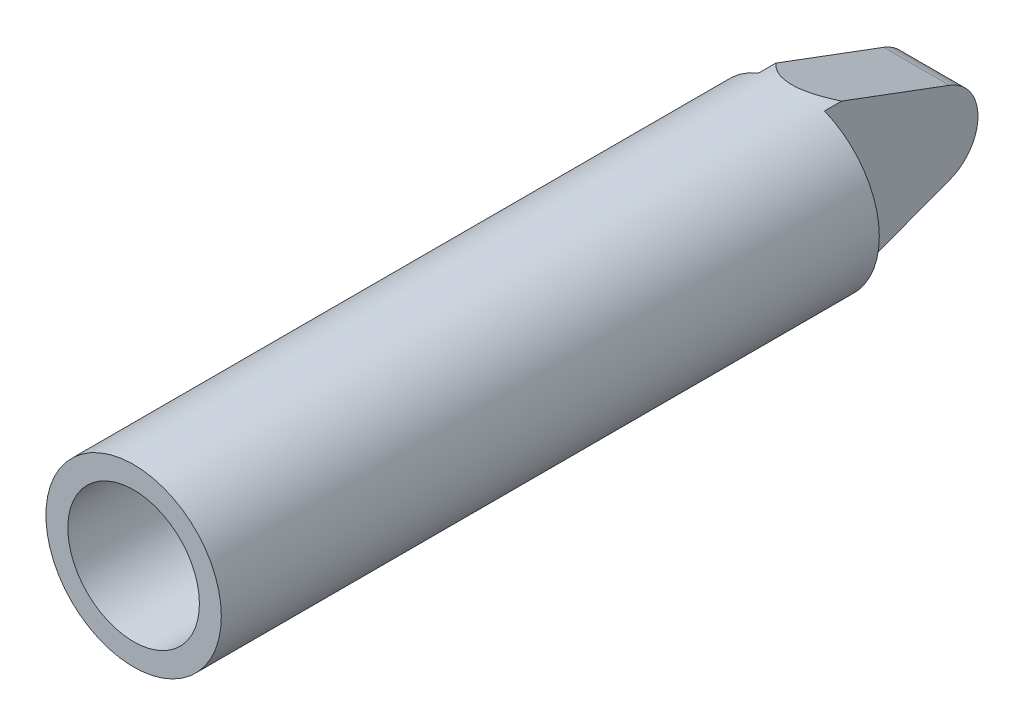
ISO-10303-21;
HEADER;
FILE_DESCRIPTION(('STEP AP214'),'2;1');
FILE_NAME('part.step','',(''),(''),'','','');
FILE_SCHEMA(('AUTOMOTIVE_DESIGN { 1 0 10303 214 1 1 1 1 }'));
ENDSEC;
DATA;
#1=APPLICATION_CONTEXT('core data for automotive mechanical design processes');
#2=APPLICATION_PROTOCOL_DEFINITION('international standard','automotive_design',2000,#1);
#3=PRODUCT_CONTEXT('',#1,'mechanical');
#4=PRODUCT('Part','Part','',(#3));
#5=PRODUCT_RELATED_PRODUCT_CATEGORY('part','',(#4));
#6=PRODUCT_DEFINITION_FORMATION('','',#4);
#7=PRODUCT_DEFINITION_CONTEXT('part definition',#1,'design');
#8=PRODUCT_DEFINITION('design','',#6,#7);
#9=PRODUCT_DEFINITION_SHAPE('','',#8);
#10=(LENGTH_UNIT() NAMED_UNIT(*) SI_UNIT(.MILLI.,.METRE.));
#11=(NAMED_UNIT(*) PLANE_ANGLE_UNIT() SI_UNIT($,.RADIAN.));
#12=(NAMED_UNIT(*) SI_UNIT($,.STERADIAN.) SOLID_ANGLE_UNIT());
#13=UNCERTAINTY_MEASURE_WITH_UNIT(LENGTH_MEASURE(1.E-05),#10,'distance_accuracy_value','');
#14=(GEOMETRIC_REPRESENTATION_CONTEXT(3) GLOBAL_UNCERTAINTY_ASSIGNED_CONTEXT((#13)) GLOBAL_UNIT_ASSIGNED_CONTEXT((#10,
#11,#12)) REPRESENTATION_CONTEXT('',''));
#15=CARTESIAN_POINT('',(0.,0.,0.));
#16=DIRECTION('',(0.,0.,1.));
#17=DIRECTION('',(1.,0.,0.));
#18=AXIS2_PLACEMENT_3D('',#15,#16,#17);
#19=CARTESIAN_POINT('',(15.,-0.431086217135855,-106.062907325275));
#20=DIRECTION('',(0.,0.936922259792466,0.349537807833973));
#21=DIRECTION('',(0.,-0.349537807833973,0.936922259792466));
#22=AXIS2_PLACEMENT_3D('',#19,#20,#21);
#23=PLANE('',#22);
#24=DIRECTION('',(0.,0.349537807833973,-0.936922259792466));
#25=VECTOR('',#24,1.);
#26=CARTESIAN_POINT('',(15.,-0.431086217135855,-106.062907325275));
#27=LINE('',#26,#25);
#28=CARTESIAN_POINT('',(15.,-37.0809924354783,-7.82428424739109));
#29=VERTEX_POINT('',#28);
#30=CARTESIAN_POINT('',(15.,-18.7384451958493,-56.9907561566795));
#31=VERTEX_POINT('',#30);
#32=EDGE_CURVE('E129',#29,#31,#27,.T.);
#33=ORIENTED_EDGE('',*,*,#32,.F.);
#34=CARTESIAN_POINT('',(0.,0.,-107.218416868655));
#35=DIRECTION('',(0.,0.936922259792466,0.349537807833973));
#36=DIRECTION('',(0.,-0.349537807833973,0.936922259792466));
#37=AXIS2_PLACEMENT_3D('',#34,#35,#36);
#38=ELLIPSE('',#37,114.43683373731,40.);
#39=CARTESIAN_POINT('',(-15.,-37.0809924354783,-7.82428424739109));
#40=VERTEX_POINT('',#39);
#41=EDGE_CURVE('E119',#40,#29,#38,.T.);
#42=ORIENTED_EDGE('',*,*,#41,.F.);
#43=DIRECTION('',(0.,0.349537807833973,-0.936922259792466));
#44=VECTOR('',#43,1.);
#45=CARTESIAN_POINT('',(-15.,-0.431086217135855,-106.062907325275));
#46=LINE('',#45,#44);
#47=CARTESIAN_POINT('',(-15.,-18.7384451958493,-56.9907561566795));
#48=VERTEX_POINT('',#47);
#49=EDGE_CURVE('E127',#40,#48,#46,.T.);
#50=ORIENTED_EDGE('',*,*,#49,.T.);
#51=DIRECTION('',(-1.,0.,0.));
#52=VECTOR('',#51,1.);
#53=CARTESIAN_POINT('',(15.,-18.7384451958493,-56.9907561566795));
#54=LINE('',#53,#52);
#55=EDGE_CURVE('E152',#31,#48,#54,.T.);
#56=ORIENTED_EDGE('',*,*,#55,.F.);
#57=EDGE_LOOP('',(#33,#42,#50,#56));
#58=FACE_BOUND('',#57,.T.);
#59=ADVANCED_FACE('F31',(#58),#23,.F.);
#60=CARTESIAN_POINT('',(15.,0.431086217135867,-106.062907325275));
#61=DIRECTION('',(0.,0.936922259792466,-0.349537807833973));
#62=DIRECTION('',(0.,0.349537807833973,0.936922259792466));
#63=AXIS2_PLACEMENT_3D('',#60,#61,#62);
#64=PLANE('',#63);
#65=DIRECTION('',(0.,-0.349537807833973,-0.936922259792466));
#66=VECTOR('',#65,1.);
#67=CARTESIAN_POINT('',(-15.,0.431086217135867,-106.062907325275));
#68=LINE('',#67,#66);
#69=CARTESIAN_POINT('',(-15.,37.0809924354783,-7.82428424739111));
#70=VERTEX_POINT('',#69);
#71=CARTESIAN_POINT('',(-15.,18.7384451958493,-56.9907561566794));
#72=VERTEX_POINT('',#71);
#73=EDGE_CURVE('E138',#70,#72,#68,.T.);
#74=ORIENTED_EDGE('',*,*,#73,.F.);
#75=CARTESIAN_POINT('',(0.,0.,-107.218416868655));
#76=DIRECTION('',(0.,0.936922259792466,-0.349537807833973));
#77=DIRECTION('',(0.,0.349537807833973,0.936922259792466));
#78=AXIS2_PLACEMENT_3D('',#75,#76,#77);
#79=ELLIPSE('',#78,114.43683373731,40.);
#80=CARTESIAN_POINT('',(15.,37.0809924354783,-7.82428424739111));
#81=VERTEX_POINT('',#80);
#82=EDGE_CURVE('E45',#70,#81,#79,.T.);
#83=ORIENTED_EDGE('',*,*,#82,.T.);
#84=DIRECTION('',(0.,-0.349537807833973,-0.936922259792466));
#85=VECTOR('',#84,1.);
#86=CARTESIAN_POINT('',(15.,0.431086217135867,-106.062907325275));
#87=LINE('',#86,#85);
#88=CARTESIAN_POINT('',(15.,18.7384451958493,-56.9907561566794));
#89=VERTEX_POINT('',#88);
#90=EDGE_CURVE('E153',#81,#89,#87,.T.);
#91=ORIENTED_EDGE('',*,*,#90,.T.);
#92=DIRECTION('',(-1.,0.,0.));
#93=VECTOR('',#92,1.);
#94=CARTESIAN_POINT('',(15.,18.7384451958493,-56.9907561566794));
#95=LINE('',#94,#93);
#96=EDGE_CURVE('E149',#89,#72,#95,.T.);
#97=ORIENTED_EDGE('',*,*,#96,.T.);
#98=EDGE_LOOP('',(#74,#83,#91,#97));
#99=FACE_BOUND('',#98,.T.);
#100=ADVANCED_FACE('F228',(#99),#64,.T.);
#101=CARTESIAN_POINT('',(15.,0.,-105.902081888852));
#102=DIRECTION('',(1.,0.,0.));
#103=DIRECTION('',(0.,0.,-1.));
#104=AXIS2_PLACEMENT_3D('',#101,#102,#103);
#105=PLANE('',#104);
#106=ORIENTED_EDGE('',*,*,#90,.F.);
#107=DIRECTION('',(0.,0.,1.));
#108=VECTOR('',#107,1.);
#109=CARTESIAN_POINT('',(15.,37.0809924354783,-70.));
#110=LINE('',#109,#108);
#111=CARTESIAN_POINT('',(15.,37.0809924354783,0.));
#112=VERTEX_POINT('',#111);
#113=EDGE_CURVE('E160',#81,#112,#110,.T.);
#114=ORIENTED_EDGE('',*,*,#113,.T.);
#115=DIRECTION('',(0.,-1.,0.));
#116=VECTOR('',#115,1.);
#117=CARTESIAN_POINT('',(15.,0.,0.));
#118=LINE('',#117,#116);
#119=CARTESIAN_POINT('',(15.,-37.0809924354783,0.));
#120=VERTEX_POINT('',#119);
#121=EDGE_CURVE('E144',#112,#120,#118,.T.);
#122=ORIENTED_EDGE('',*,*,#121,.T.);
#123=DIRECTION('',(0.,0.,1.));
#124=VECTOR('',#123,1.);
#125=CARTESIAN_POINT('',(15.,-37.0809924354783,-70.));
#126=LINE('',#125,#124);
#127=EDGE_CURVE('E130',#120,#29,#126,.F.);
#128=ORIENTED_EDGE('',*,*,#127,.T.);
#129=ORIENTED_EDGE('',*,*,#32,.T.);
#130=CARTESIAN_POINT('',(15.,0.,-50.));
#131=DIRECTION('',(1.,0.,0.));
#132=DIRECTION('',(0.,0.,-1.));
#133=AXIS2_PLACEMENT_3D('',#130,#131,#132);
#134=CIRCLE('',#133,20.);
#135=EDGE_CURVE('E225',#31,#89,#134,.T.);
#136=ORIENTED_EDGE('',*,*,#135,.T.);
#137=EDGE_LOOP('',(#106,#114,#122,#128,#129,#136));
#138=FACE_BOUND('',#137,.T.);
#139=ADVANCED_FACE('F167',(#138),#105,.T.);
#140=CARTESIAN_POINT('',(-15.,0.,-105.902081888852));
#141=DIRECTION('',(1.,0.,0.));
#142=DIRECTION('',(0.,0.,-1.));
#143=AXIS2_PLACEMENT_3D('',#140,#141,#142);
#144=PLANE('',#143);
#145=DIRECTION('',(0.,0.,1.));
#146=VECTOR('',#145,1.);
#147=CARTESIAN_POINT('',(-15.,37.0809924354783,-70.));
#148=LINE('',#147,#146);
#149=CARTESIAN_POINT('',(-15.,37.0809924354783,0.));
#150=VERTEX_POINT('',#149);
#151=EDGE_CURVE('E12',#70,#150,#148,.T.);
#152=ORIENTED_EDGE('',*,*,#151,.F.);
#153=ORIENTED_EDGE('',*,*,#73,.T.);
#154=CARTESIAN_POINT('',(-15.,0.,-50.));
#155=DIRECTION('',(1.,0.,0.));
#156=DIRECTION('',(0.,0.,-1.));
#157=AXIS2_PLACEMENT_3D('',#154,#155,#156);
#158=CIRCLE('',#157,20.);
#159=EDGE_CURVE('E134',#48,#72,#158,.T.);
#160=ORIENTED_EDGE('',*,*,#159,.F.);
#161=ORIENTED_EDGE('',*,*,#49,.F.);
#162=DIRECTION('',(0.,0.,1.));
#163=VECTOR('',#162,1.);
#164=CARTESIAN_POINT('',(-15.,-37.0809924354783,-70.));
#165=LINE('',#164,#163);
#166=CARTESIAN_POINT('',(-15.,-37.0809924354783,0.));
#167=VERTEX_POINT('',#166);
#168=EDGE_CURVE('E39',#167,#40,#165,.F.);
#169=ORIENTED_EDGE('',*,*,#168,.F.);
#170=DIRECTION('',(0.,-1.,0.));
#171=VECTOR('',#170,1.);
#172=CARTESIAN_POINT('',(-15.,0.,0.));
#173=LINE('',#172,#171);
#174=EDGE_CURVE('E123',#150,#167,#173,.T.);
#175=ORIENTED_EDGE('',*,*,#174,.F.);
#176=EDGE_LOOP('',(#152,#153,#160,#161,#169,#175));
#177=FACE_BOUND('',#176,.T.);
#178=ADVANCED_FACE('F132',(#177),#144,.F.);
#179=CARTESIAN_POINT('',(0.,0.,0.));
#180=DIRECTION('',(0.,0.,1.));
#181=DIRECTION('',(1.,0.,0.));
#182=AXIS2_PLACEMENT_3D('',#179,#180,#181);
#183=PLANE('',#182);
#184=ORIENTED_EDGE('',*,*,#121,.F.);
#185=CARTESIAN_POINT('',(0.,0.,0.));
#186=DIRECTION('',(0.,0.,1.));
#187=DIRECTION('',(1.,0.,0.));
#188=AXIS2_PLACEMENT_3D('',#185,#186,#187);
#189=CIRCLE('',#188,40.);
#190=EDGE_CURVE('E155',#120,#112,#189,.T.);
#191=ORIENTED_EDGE('',*,*,#190,.F.);
#192=EDGE_LOOP('',(#184,#191));
#193=FACE_BOUND('',#192,.T.);
#194=ADVANCED_FACE('F164',(#193),#183,.F.);
#195=CARTESIAN_POINT('',(0.,0.,300.));
#196=DIRECTION('',(0.,0.,-1.));
#197=DIRECTION('',(-1.,0.,0.));
#198=AXIS2_PLACEMENT_3D('',#195,#196,#197);
#199=CYLINDRICAL_SURFACE('',#198,40.);
#200=CARTESIAN_POINT('',(0.,0.,300.));
#201=DIRECTION('',(0.,0.,1.));
#202=DIRECTION('',(1.,0.,0.));
#203=AXIS2_PLACEMENT_3D('',#200,#201,#202);
#204=CIRCLE('',#203,40.);
#205=CARTESIAN_POINT('',(40.,0.,300.));
#206=VERTEX_POINT('',#205);
#207=EDGE_CURVE('E156',#206,#206,#204,.T.);
#208=ORIENTED_EDGE('',*,*,#207,.F.);
#209=EDGE_LOOP('',(#208));
#210=FACE_BOUND('',#209,.T.);
#211=ORIENTED_EDGE('',*,*,#190,.T.);
#212=ORIENTED_EDGE('',*,*,#113,.F.);
#213=ORIENTED_EDGE('',*,*,#82,.F.);
#214=ORIENTED_EDGE('',*,*,#151,.T.);
#215=EDGE_CURVE('E122',#150,#167,#189,.T.);
#216=ORIENTED_EDGE('',*,*,#215,.T.);
#217=ORIENTED_EDGE('',*,*,#168,.T.);
#218=ORIENTED_EDGE('',*,*,#41,.T.);
#219=ORIENTED_EDGE('',*,*,#127,.F.);
#220=EDGE_LOOP('',(#211,#212,#213,#214,#216,#217,#218,#219));
#221=FACE_BOUND('',#220,.T.);
#222=ADVANCED_FACE('F33',(#210,#221),#199,.T.);
#223=CARTESIAN_POINT('',(0.,0.,300.));
#224=DIRECTION('',(0.,0.,1.));
#225=DIRECTION('',(1.,0.,0.));
#226=AXIS2_PLACEMENT_3D('',#223,#224,#225);
#227=PLANE('',#226);
#228=CARTESIAN_POINT('',(0.,0.,300.));
#229=DIRECTION('',(0.,0.,1.));
#230=DIRECTION('',(1.,0.,0.));
#231=AXIS2_PLACEMENT_3D('',#228,#229,#230);
#232=CIRCLE('',#231,30.);
#233=CARTESIAN_POINT('',(30.,0.,300.));
#234=VERTEX_POINT('',#233);
#235=EDGE_CURVE('E178',#234,#234,#232,.T.);
#236=ORIENTED_EDGE('',*,*,#235,.F.);
#237=EDGE_LOOP('',(#236));
#238=FACE_BOUND('',#237,.T.);
#239=ORIENTED_EDGE('',*,*,#207,.T.);
#240=EDGE_LOOP('',(#239));
#241=FACE_BOUND('',#240,.T.);
#242=ADVANCED_FACE('F245',(#238,#241),#227,.T.);
#243=ORIENTED_EDGE('',*,*,#215,.F.);
#244=ORIENTED_EDGE('',*,*,#174,.T.);
#245=EDGE_LOOP('',(#243,#244));
#246=FACE_BOUND('',#245,.T.);
#247=ADVANCED_FACE('F235',(#246),#183,.F.);
#248=CARTESIAN_POINT('',(15.,0.,-50.));
#249=DIRECTION('',(-1.,0.,0.));
#250=DIRECTION('',(0.,0.,1.));
#251=AXIS2_PLACEMENT_3D('',#248,#249,#250);
#252=CYLINDRICAL_SURFACE('',#251,20.);
#253=ORIENTED_EDGE('',*,*,#159,.T.);
#254=ORIENTED_EDGE('',*,*,#96,.F.);
#255=ORIENTED_EDGE('',*,*,#135,.F.);
#256=ORIENTED_EDGE('',*,*,#55,.T.);
#257=EDGE_LOOP('',(#253,#254,#255,#256));
#258=FACE_BOUND('',#257,.T.);
#259=ADVANCED_FACE('F232',(#258),#252,.T.);
#260=CARTESIAN_POINT('',(0.,0.,10.));
#261=DIRECTION('',(0.,0.,1.));
#262=DIRECTION('',(1.,0.,0.));
#263=AXIS2_PLACEMENT_3D('',#260,#261,#262);
#264=PLANE('',#263);
#265=DIRECTION('',(0.,-1.,0.));
#266=VECTOR('',#265,1.);
#267=CARTESIAN_POINT('',(5.,0.,9.99999999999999));
#268=LINE('',#267,#266);
#269=CARTESIAN_POINT('',(5.,29.5803989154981,10.));
#270=VERTEX_POINT('',#269);
#271=CARTESIAN_POINT('',(5.,-29.5803989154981,9.99999999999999));
#272=VERTEX_POINT('',#271);
#273=EDGE_CURVE('E174',#270,#272,#268,.T.);
#274=ORIENTED_EDGE('',*,*,#273,.T.);
#275=CARTESIAN_POINT('',(0.,0.,10.));
#276=DIRECTION('',(0.,0.,1.));
#277=DIRECTION('',(1.,0.,0.));
#278=AXIS2_PLACEMENT_3D('',#275,#276,#277);
#279=CIRCLE('',#278,30.);
#280=EDGE_CURVE('E179',#272,#270,#279,.T.);
#281=ORIENTED_EDGE('',*,*,#280,.T.);
#282=EDGE_LOOP('',(#274,#281));
#283=FACE_BOUND('',#282,.T.);
#284=ADVANCED_FACE('F234',(#283),#264,.T.);
#285=CARTESIAN_POINT('',(0.,0.,300.));
#286=DIRECTION('',(0.,0.,-1.));
#287=DIRECTION('',(-1.,0.,0.));
#288=AXIS2_PLACEMENT_3D('',#285,#286,#287);
#289=CYLINDRICAL_SURFACE('',#288,30.);
#290=ORIENTED_EDGE('',*,*,#235,.T.);
#291=EDGE_LOOP('',(#290));
#292=FACE_BOUND('',#291,.T.);
#293=DIRECTION('',(0.,0.,-1.));
#294=VECTOR('',#293,1.);
#295=CARTESIAN_POINT('',(5.,29.5803989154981,10.));
#296=LINE('',#295,#294);
#297=CARTESIAN_POINT('',(5.,29.5803989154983,0.679880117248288));
#298=VERTEX_POINT('',#297);
#299=EDGE_CURVE('E211',#270,#298,#296,.T.);
#300=ORIENTED_EDGE('',*,*,#299,.F.);
#301=ORIENTED_EDGE('',*,*,#280,.F.);
#302=DIRECTION('',(0.,0.,-1.));
#303=VECTOR('',#302,1.);
#304=CARTESIAN_POINT('',(5.,-29.5803989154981,9.99999999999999));
#305=LINE('',#304,#303);
#306=CARTESIAN_POINT('',(5.,-29.5803989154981,0.679880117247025));
#307=VERTEX_POINT('',#306);
#308=EDGE_CURVE('E141',#272,#307,#305,.T.);
#309=ORIENTED_EDGE('',*,*,#308,.T.);
#310=CARTESIAN_POINT('',(0.,0.,-78.6092084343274));
#311=DIRECTION('',(0.,0.936922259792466,0.349537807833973));
#312=DIRECTION('',(0.,0.349537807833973,-0.936922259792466));
#313=AXIS2_PLACEMENT_3D('',#310,#311,#312);
#314=ELLIPSE('',#313,85.8276253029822,30.);
#315=CARTESIAN_POINT('',(-5.,-29.5803989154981,0.679880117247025));
#316=VERTEX_POINT('',#315);
#317=EDGE_CURVE('E214',#316,#307,#314,.T.);
#318=ORIENTED_EDGE('',*,*,#317,.F.);
#319=DIRECTION('',(0.,0.,-1.));
#320=VECTOR('',#319,1.);
#321=CARTESIAN_POINT('',(-5.,-29.5803989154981,10.));
#322=LINE('',#321,#320);
#323=CARTESIAN_POINT('',(-5.,-29.5803989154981,10.));
#324=VERTEX_POINT('',#323);
#325=EDGE_CURVE('E217',#324,#316,#322,.T.);
#326=ORIENTED_EDGE('',*,*,#325,.F.);
#327=CARTESIAN_POINT('',(0.,0.,10.));
#328=DIRECTION('',(0.,0.,1.));
#329=DIRECTION('',(1.,0.,0.));
#330=AXIS2_PLACEMENT_3D('',#327,#328,#329);
#331=CIRCLE('',#330,30.);
#332=CARTESIAN_POINT('',(-5.,29.5803989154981,9.99999999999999));
#333=VERTEX_POINT('',#332);
#334=EDGE_CURVE('E182',#333,#324,#331,.T.);
#335=ORIENTED_EDGE('',*,*,#334,.F.);
#336=DIRECTION('',(0.,0.,-1.));
#337=VECTOR('',#336,1.);
#338=CARTESIAN_POINT('',(-5.,29.5803989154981,9.99999999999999));
#339=LINE('',#338,#337);
#340=CARTESIAN_POINT('',(-5.,29.580398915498,0.679880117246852));
#341=VERTEX_POINT('',#340);
#342=EDGE_CURVE('E188',#333,#341,#339,.T.);
#343=ORIENTED_EDGE('',*,*,#342,.T.);
#344=CARTESIAN_POINT('',(0.,0.,-78.6092084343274));
#345=DIRECTION('',(0.,0.936922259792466,-0.349537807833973));
#346=DIRECTION('',(0.,-0.349537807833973,-0.936922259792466));
#347=AXIS2_PLACEMENT_3D('',#344,#345,#346);
#348=ELLIPSE('',#347,85.8276253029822,30.);
#349=EDGE_CURVE('E136',#298,#341,#348,.F.);
#350=ORIENTED_EDGE('',*,*,#349,.F.);
#351=EDGE_LOOP('',(#300,#301,#309,#318,#326,#335,#343,#350));
#352=FACE_BOUND('',#351,.T.);
#353=ADVANCED_FACE('F241',(#292,#352),#289,.F.);
#354=ORIENTED_EDGE('',*,*,#334,.T.);
#355=DIRECTION('',(0.,-1.,0.));
#356=VECTOR('',#355,1.);
#357=CARTESIAN_POINT('',(-5.,0.,9.99999999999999));
#358=LINE('',#357,#356);
#359=EDGE_CURVE('E177',#333,#324,#358,.T.);
#360=ORIENTED_EDGE('',*,*,#359,.F.);
#361=EDGE_LOOP('',(#354,#360));
#362=FACE_BOUND('',#361,.T.);
#363=ADVANCED_FACE('F244',(#362),#264,.T.);
#364=CARTESIAN_POINT('',(15.,8.9381363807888,-102.567529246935));
#365=DIRECTION('',(0.,0.936922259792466,0.349537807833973));
#366=DIRECTION('',(0.,-0.349537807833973,0.936922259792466));
#367=AXIS2_PLACEMENT_3D('',#364,#365,#366);
#368=PLANE('',#367);
#369=DIRECTION('',(0.,0.349537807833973,-0.936922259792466));
#370=VECTOR('',#369,1.);
#371=CARTESIAN_POINT('',(5.,8.9381363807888,-102.567529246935));
#372=LINE('',#371,#370);
#373=CARTESIAN_POINT('',(5.,-9.36922259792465,-53.4953780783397));
#374=VERTEX_POINT('',#373);
#375=EDGE_CURVE('E192',#307,#374,#372,.T.);
#376=ORIENTED_EDGE('',*,*,#375,.T.);
#377=DIRECTION('',(-1.,0.,0.));
#378=VECTOR('',#377,1.);
#379=CARTESIAN_POINT('',(15.,-9.36922259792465,-53.4953780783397));
#380=LINE('',#379,#378);
#381=CARTESIAN_POINT('',(-5.,-9.36922259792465,-53.4953780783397));
#382=VERTEX_POINT('',#381);
#383=EDGE_CURVE('E183',#374,#382,#380,.T.);
#384=ORIENTED_EDGE('',*,*,#383,.T.);
#385=DIRECTION('',(0.,0.349537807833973,-0.936922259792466));
#386=VECTOR('',#385,1.);
#387=CARTESIAN_POINT('',(-5.,8.9381363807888,-102.567529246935));
#388=LINE('',#387,#386);
#389=EDGE_CURVE('E170',#316,#382,#388,.T.);
#390=ORIENTED_EDGE('',*,*,#389,.F.);
#391=ORIENTED_EDGE('',*,*,#317,.T.);
#392=EDGE_LOOP('',(#376,#384,#390,#391));
#393=FACE_BOUND('',#392,.T.);
#394=ADVANCED_FACE('F274',(#393),#368,.T.);
#395=CARTESIAN_POINT('',(15.,0.,-50.));
#396=DIRECTION('',(-1.,0.,0.));
#397=DIRECTION('',(0.,0.,1.));
#398=AXIS2_PLACEMENT_3D('',#395,#396,#397);
#399=CYLINDRICAL_SURFACE('',#398,9.99999999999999);
#400=CARTESIAN_POINT('',(-5.,0.,-50.));
#401=DIRECTION('',(1.,0.,0.));
#402=DIRECTION('',(0.,0.,-1.));
#403=AXIS2_PLACEMENT_3D('',#400,#401,#402);
#404=CIRCLE('',#403,9.99999999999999);
#405=CARTESIAN_POINT('',(-5.,9.36922259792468,-53.4953780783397));
#406=VERTEX_POINT('',#405);
#407=EDGE_CURVE('E193',#382,#406,#404,.T.);
#408=ORIENTED_EDGE('',*,*,#407,.F.);
#409=ORIENTED_EDGE('',*,*,#383,.F.);
#410=CARTESIAN_POINT('',(5.,0.,-50.));
#411=DIRECTION('',(1.,0.,0.));
#412=DIRECTION('',(0.,0.,-1.));
#413=AXIS2_PLACEMENT_3D('',#410,#411,#412);
#414=CIRCLE('',#413,9.99999999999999);
#415=CARTESIAN_POINT('',(5.,9.36922259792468,-53.4953780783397));
#416=VERTEX_POINT('',#415);
#417=EDGE_CURVE('E198',#374,#416,#414,.T.);
#418=ORIENTED_EDGE('',*,*,#417,.T.);
#419=DIRECTION('',(1.,0.,0.));
#420=VECTOR('',#419,1.);
#421=CARTESIAN_POINT('',(15.,9.36922259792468,-53.4953780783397));
#422=LINE('',#421,#420);
#423=EDGE_CURVE('E197',#416,#406,#422,.F.);
#424=ORIENTED_EDGE('',*,*,#423,.T.);
#425=EDGE_LOOP('',(#408,#409,#418,#424));
#426=FACE_BOUND('',#425,.T.);
#427=ADVANCED_FACE('F285',(#426),#399,.F.);
#428=CARTESIAN_POINT('',(15.,-8.93813638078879,-102.567529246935));
#429=DIRECTION('',(0.,0.936922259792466,-0.349537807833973));
#430=DIRECTION('',(0.,0.349537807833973,0.936922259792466));
#431=AXIS2_PLACEMENT_3D('',#428,#429,#430);
#432=PLANE('',#431);
#433=DIRECTION('',(0.,-0.349537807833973,-0.936922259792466));
#434=VECTOR('',#433,1.);
#435=CARTESIAN_POINT('',(-5.,-8.93813638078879,-102.567529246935));
#436=LINE('',#435,#434);
#437=EDGE_CURVE('E189',#341,#406,#436,.T.);
#438=ORIENTED_EDGE('',*,*,#437,.T.);
#439=ORIENTED_EDGE('',*,*,#423,.F.);
#440=DIRECTION('',(0.,-0.349537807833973,-0.936922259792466));
#441=VECTOR('',#440,1.);
#442=CARTESIAN_POINT('',(5.,-8.93813638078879,-102.567529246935));
#443=LINE('',#442,#441);
#444=EDGE_CURVE('E194',#298,#416,#443,.T.);
#445=ORIENTED_EDGE('',*,*,#444,.F.);
#446=ORIENTED_EDGE('',*,*,#349,.T.);
#447=EDGE_LOOP('',(#438,#439,#445,#446));
#448=FACE_BOUND('',#447,.T.);
#449=ADVANCED_FACE('F290',(#448),#432,.F.);
#450=CARTESIAN_POINT('',(5.,0.,-105.902081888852));
#451=DIRECTION('',(1.,0.,0.));
#452=DIRECTION('',(0.,0.,-1.));
#453=AXIS2_PLACEMENT_3D('',#450,#451,#452);
#454=PLANE('',#453);
#455=ORIENTED_EDGE('',*,*,#308,.F.);
#456=ORIENTED_EDGE('',*,*,#273,.F.);
#457=ORIENTED_EDGE('',*,*,#299,.T.);
#458=ORIENTED_EDGE('',*,*,#444,.T.);
#459=ORIENTED_EDGE('',*,*,#417,.F.);
#460=ORIENTED_EDGE('',*,*,#375,.F.);
#461=EDGE_LOOP('',(#455,#456,#457,#458,#459,#460));
#462=FACE_BOUND('',#461,.T.);
#463=ADVANCED_FACE('F271',(#462),#454,.F.);
#464=CARTESIAN_POINT('',(-5.,0.,-105.902081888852));
#465=DIRECTION('',(1.,0.,0.));
#466=DIRECTION('',(0.,0.,-1.));
#467=AXIS2_PLACEMENT_3D('',#464,#465,#466);
#468=PLANE('',#467);
#469=ORIENTED_EDGE('',*,*,#389,.T.);
#470=ORIENTED_EDGE('',*,*,#407,.T.);
#471=ORIENTED_EDGE('',*,*,#437,.F.);
#472=ORIENTED_EDGE('',*,*,#342,.F.);
#473=ORIENTED_EDGE('',*,*,#359,.T.);
#474=ORIENTED_EDGE('',*,*,#325,.T.);
#475=EDGE_LOOP('',(#469,#470,#471,#472,#473,#474));
#476=FACE_BOUND('',#475,.T.);
#477=ADVANCED_FACE('F277',(#476),#468,.T.);
#478=CLOSED_SHELL('',(#59,#100,#139,#178,#194,#222,#242,#247,#259,#284,#353,#363,#394,#427,#449,
#463,#477));
#479=MANIFOLD_SOLID_BREP('B2',#478);
#480=ADVANCED_BREP_SHAPE_REPRESENTATION('',(#18,#479),#14);
#481=SHAPE_DEFINITION_REPRESENTATION(#9,#480);
ENDSEC;
END-ISO-10303-21;
